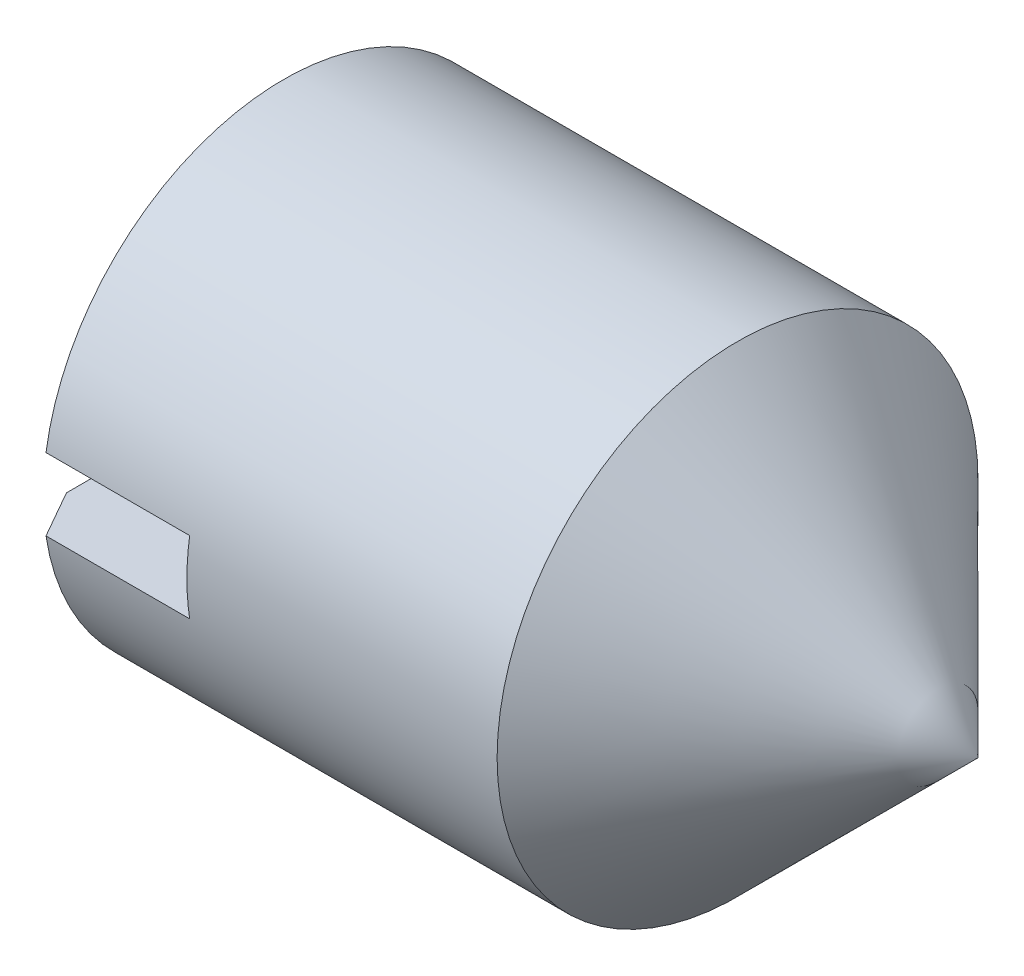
from build123d import *

# Parameters (mm, degrees)
SKETCH2_W  = 4
SKETCH2_H  = 0.6
SLOT_DEPTH = 1.42


with BuildPart() as part:
    # BodySke → BaseBody (revolve)
    with BuildSketch(Plane.XY, mode=Mode.PRIVATE) as basebody_sk:
        Polygon((0, 0), (0, 1.61), (0.225166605, 2), (4, 2), (6, 0), align=None)
    revolve(basebody_sk.sketch.rotate(Axis((-12.7, 0, 0), (1, 0, 0)), 90), axis=Axis((-12.7, 0, 0), (1, 0, 0)))

    # Sketch2 → Slot (cut)
    with BuildSketch(Plane.ZY):
        Rectangle(SKETCH2_W, SKETCH2_H)
    extrude(amount=-SLOT_DEPTH, mode=Mode.SUBTRACT)


solid = part.part
